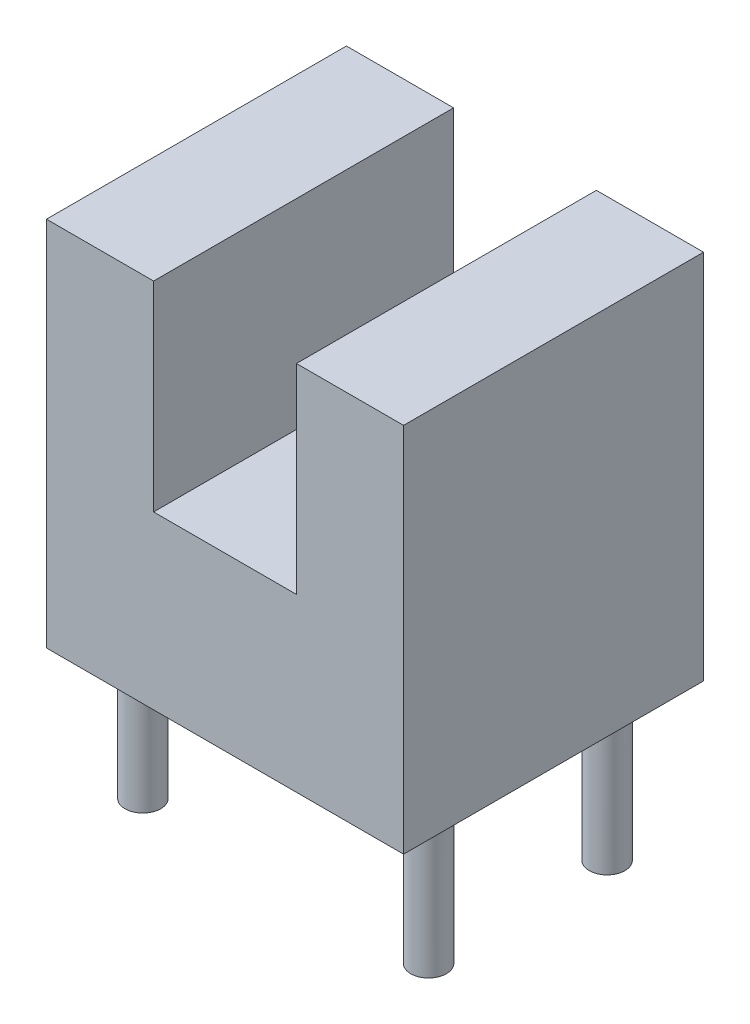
ISO-10303-21;
HEADER;
FILE_DESCRIPTION(('STEP AP214'),'2;1');
FILE_NAME('part.step','',(''),(''),'','','');
FILE_SCHEMA(('AUTOMOTIVE_DESIGN { 1 0 10303 214 1 1 1 1 }'));
ENDSEC;
DATA;
#1=APPLICATION_CONTEXT('core data for automotive mechanical design processes');
#2=APPLICATION_PROTOCOL_DEFINITION('international standard','automotive_design',2000,#1);
#3=PRODUCT_CONTEXT('',#1,'mechanical');
#4=PRODUCT('Part','Part','',(#3));
#5=PRODUCT_RELATED_PRODUCT_CATEGORY('part','',(#4));
#6=PRODUCT_DEFINITION_FORMATION('','',#4);
#7=PRODUCT_DEFINITION_CONTEXT('part definition',#1,'design');
#8=PRODUCT_DEFINITION('design','',#6,#7);
#9=PRODUCT_DEFINITION_SHAPE('','',#8);
#10=(LENGTH_UNIT() NAMED_UNIT(*) SI_UNIT(.MILLI.,.METRE.));
#11=(NAMED_UNIT(*) PLANE_ANGLE_UNIT() SI_UNIT($,.RADIAN.));
#12=(NAMED_UNIT(*) SI_UNIT($,.STERADIAN.) SOLID_ANGLE_UNIT());
#13=UNCERTAINTY_MEASURE_WITH_UNIT(LENGTH_MEASURE(1.E-05),#10,'distance_accuracy_value','');
#14=(GEOMETRIC_REPRESENTATION_CONTEXT(3) GLOBAL_UNCERTAINTY_ASSIGNED_CONTEXT((#13)) GLOBAL_UNIT_ASSIGNED_CONTEXT((#10,
#11,#12)) REPRESENTATION_CONTEXT('',''));
#15=CARTESIAN_POINT('',(0.,0.,0.));
#16=DIRECTION('',(0.,0.,1.));
#17=DIRECTION('',(1.,0.,0.));
#18=AXIS2_PLACEMENT_3D('',#15,#16,#17);
#19=CARTESIAN_POINT('',(-2.5,0.,4.2));
#20=DIRECTION('',(1.,0.,0.));
#21=DIRECTION('',(0.,1.,0.));
#22=AXIS2_PLACEMENT_3D('',#19,#20,#21);
#23=PLANE('',#22);
#24=DIRECTION('',(0.,-1.,0.));
#25=VECTOR('',#24,1.);
#26=CARTESIAN_POINT('',(-2.5,0.,0.));
#27=LINE('',#26,#25);
#28=CARTESIAN_POINT('',(-2.5,5.2,0.));
#29=VERTEX_POINT('',#28);
#30=CARTESIAN_POINT('',(-2.5,0.,0.));
#31=VERTEX_POINT('',#30);
#32=EDGE_CURVE('E134',#29,#31,#27,.T.);
#33=ORIENTED_EDGE('',*,*,#32,.T.);
#34=DIRECTION('',(0.,0.,-1.));
#35=VECTOR('',#34,1.);
#36=CARTESIAN_POINT('',(-2.5,0.,4.2));
#37=LINE('',#36,#35);
#38=CARTESIAN_POINT('',(-2.5,0.,4.2));
#39=VERTEX_POINT('',#38);
#40=EDGE_CURVE('E162',#39,#31,#37,.T.);
#41=ORIENTED_EDGE('',*,*,#40,.F.);
#42=DIRECTION('',(0.,-1.,0.));
#43=VECTOR('',#42,1.);
#44=CARTESIAN_POINT('',(-2.5,0.,4.2));
#45=LINE('',#44,#43);
#46=CARTESIAN_POINT('',(-2.5,5.2,4.2));
#47=VERTEX_POINT('',#46);
#48=EDGE_CURVE('E149',#47,#39,#45,.T.);
#49=ORIENTED_EDGE('',*,*,#48,.F.);
#50=DIRECTION('',(0.,0.,-1.));
#51=VECTOR('',#50,1.);
#52=CARTESIAN_POINT('',(-2.5,5.2,4.2));
#53=LINE('',#52,#51);
#54=EDGE_CURVE('E130',#47,#29,#53,.T.);
#55=ORIENTED_EDGE('',*,*,#54,.T.);
#56=EDGE_LOOP('',(#33,#41,#49,#55));
#57=FACE_BOUND('',#56,.T.);
#58=ADVANCED_FACE('F37',(#57),#23,.F.);
#59=CARTESIAN_POINT('',(-2.5,0.,4.2));
#60=DIRECTION('',(0.,1.,0.));
#61=DIRECTION('',(-1.,0.,0.));
#62=AXIS2_PLACEMENT_3D('',#59,#60,#61);
#63=PLANE('',#62);
#64=CARTESIAN_POINT('',(-2.,0.,0.85));
#65=DIRECTION('',(0.,1.,0.));
#66=DIRECTION('',(-1.,0.,0.));
#67=AXIS2_PLACEMENT_3D('',#64,#65,#66);
#68=CIRCLE('',#67,0.25);
#69=CARTESIAN_POINT('',(-2.25,0.,0.85));
#70=VERTEX_POINT('',#69);
#71=EDGE_CURVE('E11',#70,#70,#68,.F.);
#72=ORIENTED_EDGE('',*,*,#71,.F.);
#73=EDGE_LOOP('',(#72));
#74=FACE_BOUND('',#73,.T.);
#75=CARTESIAN_POINT('',(2.,0.,0.85));
#76=DIRECTION('',(0.,1.,0.));
#77=DIRECTION('',(-1.,0.,0.));
#78=AXIS2_PLACEMENT_3D('',#75,#76,#77);
#79=CIRCLE('',#78,0.25);
#80=CARTESIAN_POINT('',(1.75,0.,0.85));
#81=VERTEX_POINT('',#80);
#82=EDGE_CURVE('E45',#81,#81,#79,.F.);
#83=ORIENTED_EDGE('',*,*,#82,.F.);
#84=EDGE_LOOP('',(#83));
#85=FACE_BOUND('',#84,.T.);
#86=CARTESIAN_POINT('',(2.,0.,3.35));
#87=DIRECTION('',(0.,1.,0.));
#88=DIRECTION('',(-1.,0.,0.));
#89=AXIS2_PLACEMENT_3D('',#86,#87,#88);
#90=CIRCLE('',#89,0.25);
#91=CARTESIAN_POINT('',(1.75,0.,3.35));
#92=VERTEX_POINT('',#91);
#93=EDGE_CURVE('E167',#92,#92,#90,.F.);
#94=ORIENTED_EDGE('',*,*,#93,.F.);
#95=EDGE_LOOP('',(#94));
#96=FACE_BOUND('',#95,.T.);
#97=CARTESIAN_POINT('',(-2.,0.,3.35));
#98=DIRECTION('',(0.,1.,0.));
#99=DIRECTION('',(-1.,0.,0.));
#100=AXIS2_PLACEMENT_3D('',#97,#98,#99);
#101=CIRCLE('',#100,0.25);
#102=CARTESIAN_POINT('',(-2.25,0.,3.35));
#103=VERTEX_POINT('',#102);
#104=EDGE_CURVE('E164',#103,#103,#101,.F.);
#105=ORIENTED_EDGE('',*,*,#104,.F.);
#106=EDGE_LOOP('',(#105));
#107=FACE_BOUND('',#106,.T.);
#108=DIRECTION('',(1.,0.,0.));
#109=VECTOR('',#108,1.);
#110=CARTESIAN_POINT('',(-2.5,0.,0.));
#111=LINE('',#110,#109);
#112=CARTESIAN_POINT('',(2.5,0.,0.));
#113=VERTEX_POINT('',#112);
#114=EDGE_CURVE('E137',#31,#113,#111,.T.);
#115=ORIENTED_EDGE('',*,*,#114,.T.);
#116=DIRECTION('',(0.,0.,-1.));
#117=VECTOR('',#116,1.);
#118=CARTESIAN_POINT('',(2.5,0.,4.2));
#119=LINE('',#118,#117);
#120=CARTESIAN_POINT('',(2.5,0.,4.2));
#121=VERTEX_POINT('',#120);
#122=EDGE_CURVE('E159',#121,#113,#119,.T.);
#123=ORIENTED_EDGE('',*,*,#122,.F.);
#124=DIRECTION('',(1.,0.,0.));
#125=VECTOR('',#124,1.);
#126=CARTESIAN_POINT('',(-2.5,0.,4.2));
#127=LINE('',#126,#125);
#128=EDGE_CURVE('E97',#39,#121,#127,.T.);
#129=ORIENTED_EDGE('',*,*,#128,.F.);
#130=ORIENTED_EDGE('',*,*,#40,.T.);
#131=EDGE_LOOP('',(#115,#123,#129,#130));
#132=FACE_BOUND('',#131,.T.);
#133=ADVANCED_FACE('F174',(#74,#85,#96,#107,#132),#63,.F.);
#134=CARTESIAN_POINT('',(2.5,0.,4.2));
#135=DIRECTION('',(-1.,0.,0.));
#136=DIRECTION('',(0.,0.,1.));
#137=AXIS2_PLACEMENT_3D('',#134,#135,#136);
#138=PLANE('',#137);
#139=DIRECTION('',(0.,1.,0.));
#140=VECTOR('',#139,1.);
#141=CARTESIAN_POINT('',(2.5,0.,0.));
#142=LINE('',#141,#140);
#143=CARTESIAN_POINT('',(2.5,5.2,0.));
#144=VERTEX_POINT('',#143);
#145=EDGE_CURVE('E140',#113,#144,#142,.T.);
#146=ORIENTED_EDGE('',*,*,#145,.T.);
#147=DIRECTION('',(0.,0.,-1.));
#148=VECTOR('',#147,1.);
#149=CARTESIAN_POINT('',(2.5,5.2,4.2));
#150=LINE('',#149,#148);
#151=CARTESIAN_POINT('',(2.5,5.2,4.2));
#152=VERTEX_POINT('',#151);
#153=EDGE_CURVE('E156',#152,#144,#150,.T.);
#154=ORIENTED_EDGE('',*,*,#153,.F.);
#155=DIRECTION('',(0.,1.,0.));
#156=VECTOR('',#155,1.);
#157=CARTESIAN_POINT('',(2.5,0.,4.2));
#158=LINE('',#157,#156);
#159=EDGE_CURVE('E189',#121,#152,#158,.T.);
#160=ORIENTED_EDGE('',*,*,#159,.F.);
#161=ORIENTED_EDGE('',*,*,#122,.T.);
#162=EDGE_LOOP('',(#146,#154,#160,#161));
#163=FACE_BOUND('',#162,.T.);
#164=ADVANCED_FACE('F177',(#163),#138,.F.);
#165=CARTESIAN_POINT('',(0.999999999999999,5.2,4.2));
#166=DIRECTION('',(0.,-1.,0.));
#167=DIRECTION('',(1.,0.,0.));
#168=AXIS2_PLACEMENT_3D('',#165,#166,#167);
#169=PLANE('',#168);
#170=DIRECTION('',(-1.,0.,0.));
#171=VECTOR('',#170,1.);
#172=CARTESIAN_POINT('',(0.999999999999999,5.2,0.));
#173=LINE('',#172,#171);
#174=CARTESIAN_POINT('',(0.999999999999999,5.2,0.));
#175=VERTEX_POINT('',#174);
#176=EDGE_CURVE('E142',#144,#175,#173,.T.);
#177=ORIENTED_EDGE('',*,*,#176,.T.);
#178=DIRECTION('',(0.,0.,-1.));
#179=VECTOR('',#178,1.);
#180=CARTESIAN_POINT('',(0.999999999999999,5.2,4.2));
#181=LINE('',#180,#179);
#182=CARTESIAN_POINT('',(0.999999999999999,5.2,4.2));
#183=VERTEX_POINT('',#182);
#184=EDGE_CURVE('E153',#183,#175,#181,.T.);
#185=ORIENTED_EDGE('',*,*,#184,.F.);
#186=DIRECTION('',(-1.,0.,0.));
#187=VECTOR('',#186,1.);
#188=CARTESIAN_POINT('',(0.999999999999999,5.2,4.2));
#189=LINE('',#188,#187);
#190=EDGE_CURVE('E199',#152,#183,#189,.T.);
#191=ORIENTED_EDGE('',*,*,#190,.F.);
#192=ORIENTED_EDGE('',*,*,#153,.T.);
#193=EDGE_LOOP('',(#177,#185,#191,#192));
#194=FACE_BOUND('',#193,.T.);
#195=ADVANCED_FACE('F195',(#194),#169,.F.);
#196=CARTESIAN_POINT('',(0.999999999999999,5.2,4.2));
#197=DIRECTION('',(1.,0.,0.));
#198=DIRECTION('',(0.,1.,0.));
#199=AXIS2_PLACEMENT_3D('',#196,#197,#198);
#200=PLANE('',#199);
#201=DIRECTION('',(0.,-1.,0.));
#202=VECTOR('',#201,1.);
#203=CARTESIAN_POINT('',(0.999999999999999,5.2,0.));
#204=LINE('',#203,#202);
#205=CARTESIAN_POINT('',(0.999999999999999,2.4,0.));
#206=VERTEX_POINT('',#205);
#207=EDGE_CURVE('E144',#175,#206,#204,.T.);
#208=ORIENTED_EDGE('',*,*,#207,.T.);
#209=DIRECTION('',(0.,0.,-1.));
#210=VECTOR('',#209,1.);
#211=CARTESIAN_POINT('',(0.999999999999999,2.4,4.2));
#212=LINE('',#211,#210);
#213=CARTESIAN_POINT('',(0.999999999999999,2.4,4.2));
#214=VERTEX_POINT('',#213);
#215=EDGE_CURVE('E125',#214,#206,#212,.T.);
#216=ORIENTED_EDGE('',*,*,#215,.F.);
#217=DIRECTION('',(0.,-1.,0.));
#218=VECTOR('',#217,1.);
#219=CARTESIAN_POINT('',(0.999999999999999,5.2,4.2));
#220=LINE('',#219,#218);
#221=EDGE_CURVE('E116',#183,#214,#220,.T.);
#222=ORIENTED_EDGE('',*,*,#221,.F.);
#223=ORIENTED_EDGE('',*,*,#184,.T.);
#224=EDGE_LOOP('',(#208,#216,#222,#223));
#225=FACE_BOUND('',#224,.T.);
#226=ADVANCED_FACE('F198',(#225),#200,.F.);
#227=CARTESIAN_POINT('',(0.999999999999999,2.4,4.2));
#228=DIRECTION('',(0.,-1.,0.));
#229=DIRECTION('',(1.,0.,0.));
#230=AXIS2_PLACEMENT_3D('',#227,#228,#229);
#231=PLANE('',#230);
#232=DIRECTION('',(-1.,0.,0.));
#233=VECTOR('',#232,1.);
#234=CARTESIAN_POINT('',(0.999999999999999,2.4,0.));
#235=LINE('',#234,#233);
#236=CARTESIAN_POINT('',(-1.,2.4,0.));
#237=VERTEX_POINT('',#236);
#238=EDGE_CURVE('E124',#206,#237,#235,.T.);
#239=ORIENTED_EDGE('',*,*,#238,.T.);
#240=DIRECTION('',(0.,0.,-1.));
#241=VECTOR('',#240,1.);
#242=CARTESIAN_POINT('',(-1.,2.4,4.2));
#243=LINE('',#242,#241);
#244=CARTESIAN_POINT('',(-1.,2.4,4.2));
#245=VERTEX_POINT('',#244);
#246=EDGE_CURVE('E121',#245,#237,#243,.T.);
#247=ORIENTED_EDGE('',*,*,#246,.F.);
#248=DIRECTION('',(-1.,0.,0.));
#249=VECTOR('',#248,1.);
#250=CARTESIAN_POINT('',(0.999999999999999,2.4,4.2));
#251=LINE('',#250,#249);
#252=EDGE_CURVE('E110',#214,#245,#251,.T.);
#253=ORIENTED_EDGE('',*,*,#252,.F.);
#254=ORIENTED_EDGE('',*,*,#215,.T.);
#255=EDGE_LOOP('',(#239,#247,#253,#254));
#256=FACE_BOUND('',#255,.T.);
#257=ADVANCED_FACE('F122',(#256),#231,.F.);
#258=CARTESIAN_POINT('',(-1.,5.2,4.2));
#259=DIRECTION('',(-1.,0.,0.));
#260=DIRECTION('',(0.,-1.,0.));
#261=AXIS2_PLACEMENT_3D('',#258,#259,#260);
#262=PLANE('',#261);
#263=DIRECTION('',(0.,1.,0.));
#264=VECTOR('',#263,1.);
#265=CARTESIAN_POINT('',(-1.,5.2,0.));
#266=LINE('',#265,#264);
#267=CARTESIAN_POINT('',(-1.,5.2,0.));
#268=VERTEX_POINT('',#267);
#269=EDGE_CURVE('E82',#237,#268,#266,.T.);
#270=ORIENTED_EDGE('',*,*,#269,.T.);
#271=DIRECTION('',(0.,0.,-1.));
#272=VECTOR('',#271,1.);
#273=CARTESIAN_POINT('',(-1.,5.2,4.2));
#274=LINE('',#273,#272);
#275=CARTESIAN_POINT('',(-1.,5.2,4.2));
#276=VERTEX_POINT('',#275);
#277=EDGE_CURVE('E126',#276,#268,#274,.T.);
#278=ORIENTED_EDGE('',*,*,#277,.F.);
#279=DIRECTION('',(0.,1.,0.));
#280=VECTOR('',#279,1.);
#281=CARTESIAN_POINT('',(-1.,5.2,4.2));
#282=LINE('',#281,#280);
#283=EDGE_CURVE('E114',#245,#276,#282,.T.);
#284=ORIENTED_EDGE('',*,*,#283,.F.);
#285=ORIENTED_EDGE('',*,*,#246,.T.);
#286=EDGE_LOOP('',(#270,#278,#284,#285));
#287=FACE_BOUND('',#286,.T.);
#288=ADVANCED_FACE('F128',(#287),#262,.F.);
#289=CARTESIAN_POINT('',(-2.5,5.2,4.2));
#290=DIRECTION('',(0.,-1.,0.));
#291=DIRECTION('',(0.,0.,-1.));
#292=AXIS2_PLACEMENT_3D('',#289,#290,#291);
#293=PLANE('',#292);
#294=DIRECTION('',(-1.,0.,0.));
#295=VECTOR('',#294,1.);
#296=CARTESIAN_POINT('',(-2.5,5.2,0.));
#297=LINE('',#296,#295);
#298=EDGE_CURVE('E88',#268,#29,#297,.T.);
#299=ORIENTED_EDGE('',*,*,#298,.T.);
#300=ORIENTED_EDGE('',*,*,#54,.F.);
#301=DIRECTION('',(-1.,0.,0.));
#302=VECTOR('',#301,1.);
#303=CARTESIAN_POINT('',(-2.5,5.2,4.2));
#304=LINE('',#303,#302);
#305=EDGE_CURVE('E53',#276,#47,#304,.T.);
#306=ORIENTED_EDGE('',*,*,#305,.F.);
#307=ORIENTED_EDGE('',*,*,#277,.T.);
#308=EDGE_LOOP('',(#299,#300,#306,#307));
#309=FACE_BOUND('',#308,.T.);
#310=ADVANCED_FACE('F237',(#309),#293,.F.);
#311=CARTESIAN_POINT('',(0.,0.,4.2));
#312=DIRECTION('',(0.,0.,-1.));
#313=DIRECTION('',(-1.,0.,0.));
#314=AXIS2_PLACEMENT_3D('',#311,#312,#313);
#315=PLANE('',#314);
#316=ORIENTED_EDGE('',*,*,#48,.T.);
#317=ORIENTED_EDGE('',*,*,#128,.T.);
#318=ORIENTED_EDGE('',*,*,#159,.T.);
#319=ORIENTED_EDGE('',*,*,#190,.T.);
#320=ORIENTED_EDGE('',*,*,#221,.T.);
#321=ORIENTED_EDGE('',*,*,#252,.T.);
#322=ORIENTED_EDGE('',*,*,#283,.T.);
#323=ORIENTED_EDGE('',*,*,#305,.T.);
#324=EDGE_LOOP('',(#316,#317,#318,#319,#320,#321,#322,#323));
#325=FACE_BOUND('',#324,.T.);
#326=ADVANCED_FACE('F112',(#325),#315,.F.);
#327=CARTESIAN_POINT('',(0.,0.,0.));
#328=DIRECTION('',(0.,0.,-1.));
#329=DIRECTION('',(-1.,0.,0.));
#330=AXIS2_PLACEMENT_3D('',#327,#328,#329);
#331=PLANE('',#330);
#332=ORIENTED_EDGE('',*,*,#32,.F.);
#333=ORIENTED_EDGE('',*,*,#298,.F.);
#334=ORIENTED_EDGE('',*,*,#269,.F.);
#335=ORIENTED_EDGE('',*,*,#238,.F.);
#336=ORIENTED_EDGE('',*,*,#207,.F.);
#337=ORIENTED_EDGE('',*,*,#176,.F.);
#338=ORIENTED_EDGE('',*,*,#145,.F.);
#339=ORIENTED_EDGE('',*,*,#114,.F.);
#340=EDGE_LOOP('',(#332,#333,#334,#335,#336,#337,#338,#339));
#341=FACE_BOUND('',#340,.T.);
#342=ADVANCED_FACE('F191',(#341),#331,.T.);
#343=CARTESIAN_POINT('',(-2.,-2.,3.35));
#344=DIRECTION('',(0.,1.,0.));
#345=DIRECTION('',(-1.,0.,0.));
#346=AXIS2_PLACEMENT_3D('',#343,#344,#345);
#347=CYLINDRICAL_SURFACE('',#346,0.25);
#348=CARTESIAN_POINT('',(-2.,-2.,3.35));
#349=DIRECTION('',(0.,-1.,0.));
#350=DIRECTION('',(1.,0.,0.));
#351=AXIS2_PLACEMENT_3D('',#348,#349,#350);
#352=CIRCLE('',#351,0.25);
#353=CARTESIAN_POINT('',(-1.75,-2.,3.35));
#354=VERTEX_POINT('',#353);
#355=EDGE_CURVE('E138',#354,#354,#352,.T.);
#356=ORIENTED_EDGE('',*,*,#355,.F.);
#357=EDGE_LOOP('',(#356));
#358=FACE_BOUND('',#357,.T.);
#359=ORIENTED_EDGE('',*,*,#104,.T.);
#360=EDGE_LOOP('',(#359));
#361=FACE_BOUND('',#360,.T.);
#362=ADVANCED_FACE('F296',(#358,#361),#347,.T.);
#363=CARTESIAN_POINT('',(-2.,-2.,3.35));
#364=DIRECTION('',(0.,-1.,0.));
#365=DIRECTION('',(1.,0.,0.));
#366=AXIS2_PLACEMENT_3D('',#363,#364,#365);
#367=PLANE('',#366);
#368=ORIENTED_EDGE('',*,*,#355,.T.);
#369=EDGE_LOOP('',(#368));
#370=FACE_BOUND('',#369,.T.);
#371=ADVANCED_FACE('F312',(#370),#367,.T.);
#372=CARTESIAN_POINT('',(2.,-2.,3.35));
#373=DIRECTION('',(0.,1.,0.));
#374=DIRECTION('',(-1.,0.,0.));
#375=AXIS2_PLACEMENT_3D('',#372,#373,#374);
#376=CYLINDRICAL_SURFACE('',#375,0.25);
#377=CARTESIAN_POINT('',(2.,-2.,3.35));
#378=DIRECTION('',(0.,-1.,0.));
#379=DIRECTION('',(1.,0.,0.));
#380=AXIS2_PLACEMENT_3D('',#377,#378,#379);
#381=CIRCLE('',#380,0.25);
#382=CARTESIAN_POINT('',(2.25,-2.,3.35));
#383=VERTEX_POINT('',#382);
#384=EDGE_CURVE('E207',#383,#383,#381,.T.);
#385=ORIENTED_EDGE('',*,*,#384,.F.);
#386=EDGE_LOOP('',(#385));
#387=FACE_BOUND('',#386,.T.);
#388=ORIENTED_EDGE('',*,*,#93,.T.);
#389=EDGE_LOOP('',(#388));
#390=FACE_BOUND('',#389,.T.);
#391=ADVANCED_FACE('F323',(#387,#390),#376,.T.);
#392=CARTESIAN_POINT('',(2.,-2.,3.35));
#393=DIRECTION('',(0.,-1.,0.));
#394=DIRECTION('',(1.,0.,0.));
#395=AXIS2_PLACEMENT_3D('',#392,#393,#394);
#396=PLANE('',#395);
#397=ORIENTED_EDGE('',*,*,#384,.T.);
#398=EDGE_LOOP('',(#397));
#399=FACE_BOUND('',#398,.T.);
#400=ADVANCED_FACE('F334',(#399),#396,.T.);
#401=CARTESIAN_POINT('',(2.,-2.,0.85));
#402=DIRECTION('',(0.,1.,0.));
#403=DIRECTION('',(-1.,0.,0.));
#404=AXIS2_PLACEMENT_3D('',#401,#402,#403);
#405=CYLINDRICAL_SURFACE('',#404,0.25);
#406=CARTESIAN_POINT('',(2.,-2.,0.85));
#407=DIRECTION('',(0.,-1.,0.));
#408=DIRECTION('',(1.,0.,0.));
#409=AXIS2_PLACEMENT_3D('',#406,#407,#408);
#410=CIRCLE('',#409,0.25);
#411=CARTESIAN_POINT('',(2.25,-2.,0.85));
#412=VERTEX_POINT('',#411);
#413=EDGE_CURVE('E210',#412,#412,#410,.T.);
#414=ORIENTED_EDGE('',*,*,#413,.F.);
#415=EDGE_LOOP('',(#414));
#416=FACE_BOUND('',#415,.T.);
#417=ORIENTED_EDGE('',*,*,#82,.T.);
#418=EDGE_LOOP('',(#417));
#419=FACE_BOUND('',#418,.T.);
#420=ADVANCED_FACE('F172',(#416,#419),#405,.T.);
#421=CARTESIAN_POINT('',(2.,-2.,0.85));
#422=DIRECTION('',(0.,-1.,0.));
#423=DIRECTION('',(1.,0.,0.));
#424=AXIS2_PLACEMENT_3D('',#421,#422,#423);
#425=PLANE('',#424);
#426=ORIENTED_EDGE('',*,*,#413,.T.);
#427=EDGE_LOOP('',(#426));
#428=FACE_BOUND('',#427,.T.);
#429=ADVANCED_FACE('F222',(#428),#425,.T.);
#430=CARTESIAN_POINT('',(-2.,-2.,0.85));
#431=DIRECTION('',(0.,1.,0.));
#432=DIRECTION('',(-1.,0.,0.));
#433=AXIS2_PLACEMENT_3D('',#430,#431,#432);
#434=CYLINDRICAL_SURFACE('',#433,0.25);
#435=CARTESIAN_POINT('',(-2.,-2.,0.85));
#436=DIRECTION('',(0.,-1.,0.));
#437=DIRECTION('',(1.,0.,0.));
#438=AXIS2_PLACEMENT_3D('',#435,#436,#437);
#439=CIRCLE('',#438,0.25);
#440=CARTESIAN_POINT('',(-1.75,-2.,0.85));
#441=VERTEX_POINT('',#440);
#442=EDGE_CURVE('E213',#441,#441,#439,.T.);
#443=ORIENTED_EDGE('',*,*,#442,.F.);
#444=EDGE_LOOP('',(#443));
#445=FACE_BOUND('',#444,.T.);
#446=ORIENTED_EDGE('',*,*,#71,.T.);
#447=EDGE_LOOP('',(#446));
#448=FACE_BOUND('',#447,.T.);
#449=ADVANCED_FACE('F219',(#445,#448),#434,.T.);
#450=CARTESIAN_POINT('',(-2.,-2.,0.85));
#451=DIRECTION('',(0.,-1.,0.));
#452=DIRECTION('',(1.,0.,0.));
#453=AXIS2_PLACEMENT_3D('',#450,#451,#452);
#454=PLANE('',#453);
#455=ORIENTED_EDGE('',*,*,#442,.T.);
#456=EDGE_LOOP('',(#455));
#457=FACE_BOUND('',#456,.T.);
#458=ADVANCED_FACE('F217',(#457),#454,.T.);
#459=CLOSED_SHELL('',(#58,#133,#164,#195,#226,#257,#288,#310,#326,#342,#362,#371,#391,#400,#420,
#429,#449,#458));
#460=MANIFOLD_SOLID_BREP('B2',#459);
#461=ADVANCED_BREP_SHAPE_REPRESENTATION('',(#18,#460),#14);
#462=SHAPE_DEFINITION_REPRESENTATION(#9,#461);
ENDSEC;
END-ISO-10303-21;
